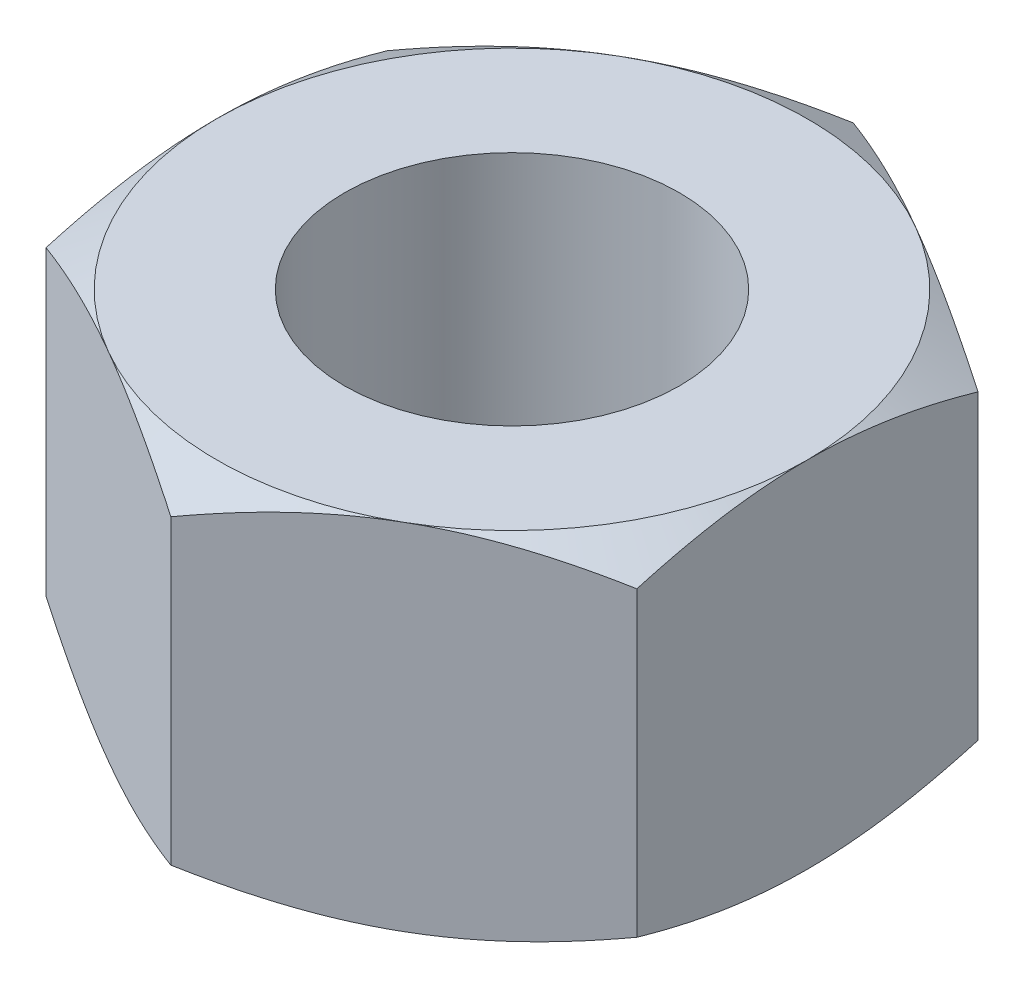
from build123d import *

# Parameters (mm, degrees)
EXTRUDE1_DEPTH          = 5.4
SKETCH2_OUTSIDE_W       = 89.934
SKETCH2_OUTSIDE_H       = 92.718
SKETCH2_OUTSIDE_R       = 9
CUT_EXTRUDE1_DEPTH      = 18.482562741
CUT_EXTRUDE1_DRAFT      = -60
MIRROR1_COPY_1_SKETCH_W = 89.934
MIRROR1_COPY_1_SKETCH_H = 92.718
MIRROR1_COPY_1_SKETCH_R = 9
MIRROR1_COPY_1_DEPTH    = 18.482562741
MIRROR1_COPY_1_DRAFT    = -60
M12X1_75_TAPPED_HOLE1_D = 10.2


with BuildPart() as part:
    # Sketch1 → Extrude1 (new, symmetric)
    with BuildSketch(Plane(origin=(0, 0, 0), x_dir=(1, 0, 0), z_dir=(0, 1, 0))):
        Polygon((0, 10.392304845), (-9, 5.196152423), (-9, -5.196152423), (0, -10.392304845), (9, -5.196152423), (9, 5.196152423), align=None)
    extrude(amount=EXTRUDE1_DEPTH, both=True)


with BuildPart() as cut_extrude1_tool:
    # Sketch2 outside → Cut-Extrude1 (with draft: the straight prism first)
    with BuildSketch(Plane(origin=(0, 5.4, 0), x_dir=(1, 0, 0), z_dir=(0, 1, 0))):
        Rectangle(SKETCH2_OUTSIDE_W, SKETCH2_OUTSIDE_H)
        Circle(SKETCH2_OUTSIDE_R, mode=Mode.SUBTRACT)
    extrude(amount=-CUT_EXTRUDE1_DEPTH)
    # Cut-Extrude1: the draft: its side faces are tilted about the plane it starts from
    cut_extrude1_sides = [cut_extrude1_tool.faces().sort_by_distance(p)[0] for p in [
        (0, -3.841281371, 46.359),
        (44.967, -3.841281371, 0),
        (0, -3.841281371, -46.359),
        (-44.967, -3.841281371, 0),
        (-9, -3.841281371, 0),
    ]]
    draft(cut_extrude1_sides, Plane(origin=(0, 5.4, 0), x_dir=(1, 0, 0), z_dir=(0, 1, 0)), CUT_EXTRUDE1_DRAFT)


with BuildPart() as part_1:
    add(part.part)

    # Cut-Extrude1: cut by cut_extrude1_tool
    add(cut_extrude1_tool.part, mode=Mode.SUBTRACT)


with BuildPart() as mirror1_copy_1_tool:
    # Mirror1 copy 1 sketch → Mirror1 copy 1 (with draft: the straight prism first)
    with BuildSketch(Plane.XZ.offset(5.4)):
        Rectangle(MIRROR1_COPY_1_SKETCH_W, MIRROR1_COPY_1_SKETCH_H)
        Circle(MIRROR1_COPY_1_SKETCH_R, mode=Mode.SUBTRACT)
    extrude(amount=-MIRROR1_COPY_1_DEPTH)
    # Mirror1 copy 1: the draft: its side faces are tilted about the plane it starts from
    mirror1_copy_1_sides = [mirror1_copy_1_tool.faces().sort_by_distance(p)[0] for p in [
        (0, 3.841281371, 46.359),
        (44.967, 3.841281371, 0),
        (0, 3.841281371, -46.359),
        (-44.967, 3.841281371, 0),
        (-9, 3.841281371, 0),
    ]]
    draft(mirror1_copy_1_sides, Plane.XZ.offset(5.4), MIRROR1_COPY_1_DRAFT)


with BuildPart() as part_2:
    add(part_1.part)

    # Mirror1 copy 1: cut by mirror1_copy_1_tool
    add(mirror1_copy_1_tool.part, mode=Mode.SUBTRACT)

    # M12x1.75 Tapped Hole1 (through all)
    with Locations(Plane(origin=(0, 5.4, 0), x_dir=(1, 0, 0), z_dir=(0, 1, 0))):
        with Locations((0, 0)):
            Hole(M12X1_75_TAPPED_HOLE1_D / 2)


solid = part_2.part
